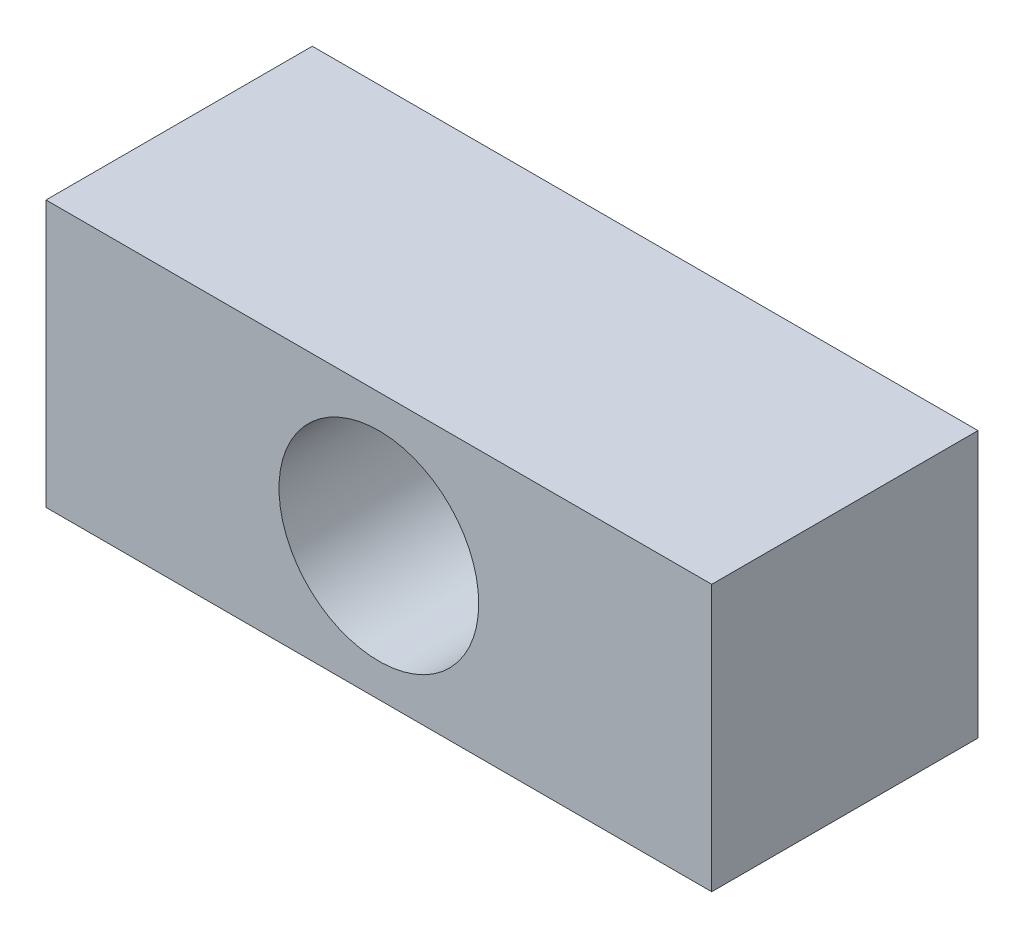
from build123d import *

# Parameters (mm, degrees)
SKIZZE1_W                       = 100
SKIZZE1_H                       = 40
SKIZZE1_R                       = 15
AUFSATZ_LINEAR_AUSTRAGEN1_DEPTH = 40


with BuildPart() as part:
    # Skizze1 → Aufsatz-Linear austragen1 (new body)
    with BuildSketch(Plane.XY):
        with Locations((50, 20)):
            Rectangle(SKIZZE1_W, SKIZZE1_H)
        with Locations((50, 20)):
            Circle(SKIZZE1_R, mode=Mode.SUBTRACT)
    extrude(amount=AUFSATZ_LINEAR_AUSTRAGEN1_DEPTH)


solid = part.part
